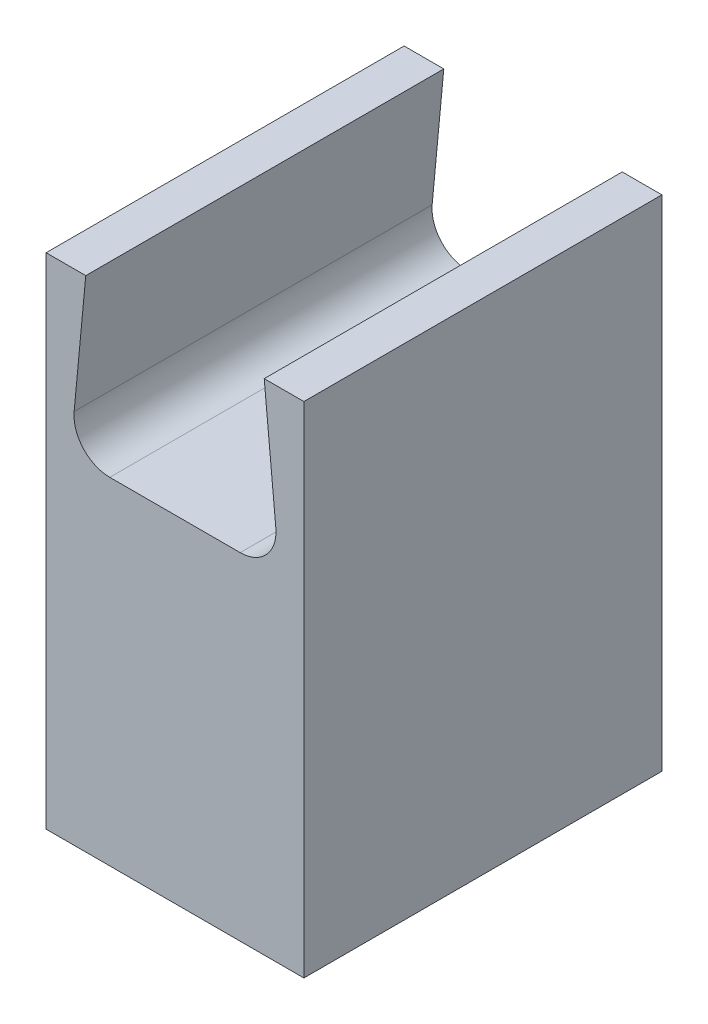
ISO-10303-21;
HEADER;
FILE_DESCRIPTION(('STEP AP214'),'2;1');
FILE_NAME('part.step','',(''),(''),'','','');
FILE_SCHEMA(('AUTOMOTIVE_DESIGN { 1 0 10303 214 1 1 1 1 }'));
ENDSEC;
DATA;
#1=APPLICATION_CONTEXT('core data for automotive mechanical design processes');
#2=APPLICATION_PROTOCOL_DEFINITION('international standard','automotive_design',2000,#1);
#3=PRODUCT_CONTEXT('',#1,'mechanical');
#4=PRODUCT('Part','Part','',(#3));
#5=PRODUCT_RELATED_PRODUCT_CATEGORY('part','',(#4));
#6=PRODUCT_DEFINITION_FORMATION('','',#4);
#7=PRODUCT_DEFINITION_CONTEXT('part definition',#1,'design');
#8=PRODUCT_DEFINITION('design','',#6,#7);
#9=PRODUCT_DEFINITION_SHAPE('','',#8);
#10=(LENGTH_UNIT() NAMED_UNIT(*) SI_UNIT(.MILLI.,.METRE.));
#11=(NAMED_UNIT(*) PLANE_ANGLE_UNIT() SI_UNIT($,.RADIAN.));
#12=(NAMED_UNIT(*) SI_UNIT($,.STERADIAN.) SOLID_ANGLE_UNIT());
#13=UNCERTAINTY_MEASURE_WITH_UNIT(LENGTH_MEASURE(1.E-05),#10,'distance_accuracy_value','');
#14=(GEOMETRIC_REPRESENTATION_CONTEXT(3) GLOBAL_UNCERTAINTY_ASSIGNED_CONTEXT((#13)) GLOBAL_UNIT_ASSIGNED_CONTEXT((#10,
#11,#12)) REPRESENTATION_CONTEXT('',''));
#15=CARTESIAN_POINT('',(0.,0.,0.));
#16=DIRECTION('',(0.,0.,1.));
#17=DIRECTION('',(1.,0.,0.));
#18=AXIS2_PLACEMENT_3D('',#15,#16,#17);
#19=CARTESIAN_POINT('',(-6.23,4.26,25.));
#20=DIRECTION('',(0.,-1.,0.));
#21=DIRECTION('',(0.,0.,-1.));
#22=AXIS2_PLACEMENT_3D('',#19,#20,#21);
#23=PLANE('',#22);
#24=DIRECTION('',(-1.,0.,0.));
#25=VECTOR('',#24,1.);
#26=CARTESIAN_POINT('',(-6.23,4.26,0.));
#27=LINE('',#26,#25);
#28=CARTESIAN_POINT('',(-6.23,4.26,0.));
#29=VERTEX_POINT('',#28);
#30=CARTESIAN_POINT('',(-9.,4.26,0.));
#31=VERTEX_POINT('',#30);
#32=EDGE_CURVE('E135',#29,#31,#27,.T.);
#33=ORIENTED_EDGE('',*,*,#32,.T.);
#34=DIRECTION('',(0.,0.,-1.));
#35=VECTOR('',#34,1.);
#36=CARTESIAN_POINT('',(-9.,4.26,25.));
#37=LINE('',#36,#35);
#38=CARTESIAN_POINT('',(-9.,4.26,25.));
#39=VERTEX_POINT('',#38);
#40=EDGE_CURVE('E116',#39,#31,#37,.T.);
#41=ORIENTED_EDGE('',*,*,#40,.F.);
#42=DIRECTION('',(-1.,0.,0.));
#43=VECTOR('',#42,1.);
#44=CARTESIAN_POINT('',(-6.23,4.26,25.));
#45=LINE('',#44,#43);
#46=CARTESIAN_POINT('',(-6.23,4.26,25.));
#47=VERTEX_POINT('',#46);
#48=EDGE_CURVE('E123',#47,#39,#45,.T.);
#49=ORIENTED_EDGE('',*,*,#48,.F.);
#50=DIRECTION('',(0.,0.,-1.));
#51=VECTOR('',#50,1.);
#52=CARTESIAN_POINT('',(-6.23,4.26,25.));
#53=LINE('',#52,#51);
#54=EDGE_CURVE('E163',#47,#29,#53,.T.);
#55=ORIENTED_EDGE('',*,*,#54,.T.);
#56=EDGE_LOOP('',(#33,#41,#49,#55));
#57=FACE_BOUND('',#56,.T.);
#58=ADVANCED_FACE('F35',(#57),#23,.F.);
#59=CARTESIAN_POINT('',(-9.,4.26,25.));
#60=DIRECTION('',(1.,0.,0.));
#61=DIRECTION('',(0.,0.,-1.));
#62=AXIS2_PLACEMENT_3D('',#59,#60,#61);
#63=PLANE('',#62);
#64=DIRECTION('',(0.,-1.,0.));
#65=VECTOR('',#64,1.);
#66=CARTESIAN_POINT('',(-9.,4.26,0.));
#67=LINE('',#66,#65);
#68=CARTESIAN_POINT('',(-9.,-30.6,0.));
#69=VERTEX_POINT('',#68);
#70=EDGE_CURVE('E199',#31,#69,#67,.T.);
#71=ORIENTED_EDGE('',*,*,#70,.T.);
#72=DIRECTION('',(0.,0.,-1.));
#73=VECTOR('',#72,1.);
#74=CARTESIAN_POINT('',(-9.,-30.6,25.));
#75=LINE('',#74,#73);
#76=CARTESIAN_POINT('',(-9.,-30.6,25.));
#77=VERTEX_POINT('',#76);
#78=EDGE_CURVE('E119',#77,#69,#75,.T.);
#79=ORIENTED_EDGE('',*,*,#78,.F.);
#80=DIRECTION('',(0.,-1.,0.));
#81=VECTOR('',#80,1.);
#82=CARTESIAN_POINT('',(-9.,4.26,25.));
#83=LINE('',#82,#81);
#84=EDGE_CURVE('E112',#39,#77,#83,.T.);
#85=ORIENTED_EDGE('',*,*,#84,.F.);
#86=ORIENTED_EDGE('',*,*,#40,.T.);
#87=EDGE_LOOP('',(#71,#79,#85,#86));
#88=FACE_BOUND('',#87,.T.);
#89=ADVANCED_FACE('F114',(#88),#63,.F.);
#90=CARTESIAN_POINT('',(-9.,-30.6,25.));
#91=DIRECTION('',(0.,1.,0.));
#92=DIRECTION('',(0.,0.,1.));
#93=AXIS2_PLACEMENT_3D('',#90,#91,#92);
#94=PLANE('',#93);
#95=DIRECTION('',(1.,0.,0.));
#96=VECTOR('',#95,1.);
#97=CARTESIAN_POINT('',(-9.,-30.6,0.));
#98=LINE('',#97,#96);
#99=CARTESIAN_POINT('',(9.,-30.6,0.));
#100=VERTEX_POINT('',#99);
#101=EDGE_CURVE('E197',#69,#100,#98,.T.);
#102=ORIENTED_EDGE('',*,*,#101,.T.);
#103=DIRECTION('',(0.,0.,-1.));
#104=VECTOR('',#103,1.);
#105=CARTESIAN_POINT('',(9.,-30.6,25.));
#106=LINE('',#105,#104);
#107=CARTESIAN_POINT('',(9.,-30.6,25.));
#108=VERTEX_POINT('',#107);
#109=EDGE_CURVE('E141',#108,#100,#106,.T.);
#110=ORIENTED_EDGE('',*,*,#109,.F.);
#111=DIRECTION('',(1.,0.,0.));
#112=VECTOR('',#111,1.);
#113=CARTESIAN_POINT('',(-9.,-30.6,25.));
#114=LINE('',#113,#112);
#115=EDGE_CURVE('E122',#77,#108,#114,.T.);
#116=ORIENTED_EDGE('',*,*,#115,.F.);
#117=ORIENTED_EDGE('',*,*,#78,.T.);
#118=EDGE_LOOP('',(#102,#110,#116,#117));
#119=FACE_BOUND('',#118,.T.);
#120=ADVANCED_FACE('F210',(#119),#94,.F.);
#121=CARTESIAN_POINT('',(9.,-30.6,25.));
#122=DIRECTION('',(-1.,0.,0.));
#123=DIRECTION('',(0.,-1.,0.));
#124=AXIS2_PLACEMENT_3D('',#121,#122,#123);
#125=PLANE('',#124);
#126=DIRECTION('',(0.,1.,0.));
#127=VECTOR('',#126,1.);
#128=CARTESIAN_POINT('',(9.,-30.6,0.));
#129=LINE('',#128,#127);
#130=CARTESIAN_POINT('',(9.,4.26,0.));
#131=VERTEX_POINT('',#130);
#132=EDGE_CURVE('E192',#100,#131,#129,.T.);
#133=ORIENTED_EDGE('',*,*,#132,.T.);
#134=DIRECTION('',(0.,0.,-1.));
#135=VECTOR('',#134,1.);
#136=CARTESIAN_POINT('',(9.,4.26,25.));
#137=LINE('',#136,#135);
#138=CARTESIAN_POINT('',(9.,4.26,25.));
#139=VERTEX_POINT('',#138);
#140=EDGE_CURVE('E183',#139,#131,#137,.T.);
#141=ORIENTED_EDGE('',*,*,#140,.F.);
#142=DIRECTION('',(0.,1.,0.));
#143=VECTOR('',#142,1.);
#144=CARTESIAN_POINT('',(9.,-30.6,25.));
#145=LINE('',#144,#143);
#146=EDGE_CURVE('E193',#108,#139,#145,.T.);
#147=ORIENTED_EDGE('',*,*,#146,.F.);
#148=ORIENTED_EDGE('',*,*,#109,.T.);
#149=EDGE_LOOP('',(#133,#141,#147,#148));
#150=FACE_BOUND('',#149,.T.);
#151=ADVANCED_FACE('F190',(#150),#125,.F.);
#152=CARTESIAN_POINT('',(9.,4.26,25.));
#153=DIRECTION('',(0.,-1.,0.));
#154=DIRECTION('',(1.,0.,0.));
#155=AXIS2_PLACEMENT_3D('',#152,#153,#154);
#156=PLANE('',#155);
#157=DIRECTION('',(-1.,0.,0.));
#158=VECTOR('',#157,1.);
#159=CARTESIAN_POINT('',(9.,4.26,0.));
#160=LINE('',#159,#158);
#161=CARTESIAN_POINT('',(6.23,4.26,0.));
#162=VERTEX_POINT('',#161);
#163=EDGE_CURVE('E175',#131,#162,#160,.T.);
#164=ORIENTED_EDGE('',*,*,#163,.T.);
#165=DIRECTION('',(0.,0.,-1.));
#166=VECTOR('',#165,1.);
#167=CARTESIAN_POINT('',(6.23,4.26,25.));
#168=LINE('',#167,#166);
#169=CARTESIAN_POINT('',(6.23,4.26,25.));
#170=VERTEX_POINT('',#169);
#171=EDGE_CURVE('E180',#170,#162,#168,.T.);
#172=ORIENTED_EDGE('',*,*,#171,.F.);
#173=DIRECTION('',(-1.,0.,0.));
#174=VECTOR('',#173,1.);
#175=CARTESIAN_POINT('',(9.,4.26,25.));
#176=LINE('',#175,#174);
#177=EDGE_CURVE('E207',#139,#170,#176,.T.);
#178=ORIENTED_EDGE('',*,*,#177,.F.);
#179=ORIENTED_EDGE('',*,*,#140,.T.);
#180=EDGE_LOOP('',(#164,#172,#178,#179));
#181=FACE_BOUND('',#180,.T.);
#182=ADVANCED_FACE('F217',(#181),#156,.F.);
#183=CARTESIAN_POINT('',(6.23,4.26,25.));
#184=DIRECTION('',(0.995593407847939,0.0937750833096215,0.));
#185=DIRECTION('',(-0.0937750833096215,0.99559340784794,0.));
#186=AXIS2_PLACEMENT_3D('',#183,#184,#185);
#187=PLANE('',#186);
#188=DIRECTION('',(0.0937750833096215,-0.995593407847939,0.));
#189=VECTOR('',#188,1.);
#190=CARTESIAN_POINT('',(6.23,4.26,0.));
#191=LINE('',#190,#189);
#192=CARTESIAN_POINT('',(7.0424429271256,-4.36556229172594,0.));
#193=VERTEX_POINT('',#192);
#194=EDGE_CURVE('E172',#162,#193,#191,.T.);
#195=ORIENTED_EDGE('',*,*,#194,.T.);
#196=DIRECTION('',(0.,0.,-1.));
#197=VECTOR('',#196,1.);
#198=CARTESIAN_POINT('',(7.0424429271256,-4.36556229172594,25.));
#199=LINE('',#198,#197);
#200=CARTESIAN_POINT('',(7.0424429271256,-4.36556229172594,25.));
#201=VERTEX_POINT('',#200);
#202=EDGE_CURVE('E50',#193,#201,#199,.F.);
#203=ORIENTED_EDGE('',*,*,#202,.T.);
#204=DIRECTION('',(0.0937750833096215,-0.995593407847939,0.));
#205=VECTOR('',#204,1.);
#206=CARTESIAN_POINT('',(6.23,4.26,25.));
#207=LINE('',#206,#205);
#208=EDGE_CURVE('E205',#170,#201,#207,.T.);
#209=ORIENTED_EDGE('',*,*,#208,.F.);
#210=ORIENTED_EDGE('',*,*,#171,.T.);
#211=EDGE_LOOP('',(#195,#203,#209,#210));
#212=FACE_BOUND('',#211,.T.);
#213=ADVANCED_FACE('F240',(#212),#187,.F.);
#214=CARTESIAN_POINT('',(7.3,-7.1,25.));
#215=DIRECTION('',(0.,-1.,0.));
#216=DIRECTION('',(1.,0.,0.));
#217=AXIS2_PLACEMENT_3D('',#214,#215,#216);
#218=PLANE('',#217);
#219=DIRECTION('',(-1.,0.,0.));
#220=VECTOR('',#219,1.);
#221=CARTESIAN_POINT('',(7.3,-7.1,0.));
#222=LINE('',#221,#220);
#223=CARTESIAN_POINT('',(4.55345940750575,-7.1,0.));
#224=VERTEX_POINT('',#223);
#225=CARTESIAN_POINT('',(-4.55345940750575,-7.1,0.));
#226=VERTEX_POINT('',#225);
#227=EDGE_CURVE('E168',#224,#226,#222,.T.);
#228=ORIENTED_EDGE('',*,*,#227,.T.);
#229=DIRECTION('',(0.,0.,-1.));
#230=VECTOR('',#229,1.);
#231=CARTESIAN_POINT('',(-4.55345940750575,-7.1,25.));
#232=LINE('',#231,#230);
#233=CARTESIAN_POINT('',(-4.55345940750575,-7.1,25.));
#234=VERTEX_POINT('',#233);
#235=EDGE_CURVE('E147',#226,#234,#232,.F.);
#236=ORIENTED_EDGE('',*,*,#235,.T.);
#237=DIRECTION('',(-1.,0.,0.));
#238=VECTOR('',#237,1.);
#239=CARTESIAN_POINT('',(7.3,-7.1,25.));
#240=LINE('',#239,#238);
#241=CARTESIAN_POINT('',(4.55345940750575,-7.1,25.));
#242=VERTEX_POINT('',#241);
#243=EDGE_CURVE('E156',#242,#234,#240,.T.);
#244=ORIENTED_EDGE('',*,*,#243,.F.);
#245=DIRECTION('',(0.,0.,-1.));
#246=VECTOR('',#245,1.);
#247=CARTESIAN_POINT('',(4.55345940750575,-7.1,0.));
#248=LINE('',#247,#246);
#249=EDGE_CURVE('E139',#242,#224,#248,.T.);
#250=ORIENTED_EDGE('',*,*,#249,.T.);
#251=EDGE_LOOP('',(#228,#236,#244,#250));
#252=FACE_BOUND('',#251,.T.);
#253=ADVANCED_FACE('F170',(#252),#218,.F.);
#254=CARTESIAN_POINT('',(-7.3,-7.1,25.));
#255=DIRECTION('',(-0.995593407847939,0.093775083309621,0.));
#256=DIRECTION('',(-0.093775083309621,-0.995593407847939,0.));
#257=AXIS2_PLACEMENT_3D('',#254,#255,#256);
#258=PLANE('',#257);
#259=DIRECTION('',(0.093775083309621,0.995593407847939,0.));
#260=VECTOR('',#259,1.);
#261=CARTESIAN_POINT('',(-7.3,-7.1,25.));
#262=LINE('',#261,#260);
#263=CARTESIAN_POINT('',(-7.04244292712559,-4.36556229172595,25.));
#264=VERTEX_POINT('',#263);
#265=EDGE_CURVE('E128',#264,#47,#262,.T.);
#266=ORIENTED_EDGE('',*,*,#265,.F.);
#267=DIRECTION('',(0.,0.,-1.));
#268=VECTOR('',#267,1.);
#269=CARTESIAN_POINT('',(-7.04244292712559,-4.36556229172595,0.));
#270=LINE('',#269,#268);
#271=CARTESIAN_POINT('',(-7.04244292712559,-4.36556229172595,0.));
#272=VERTEX_POINT('',#271);
#273=EDGE_CURVE('E136',#264,#272,#270,.T.);
#274=ORIENTED_EDGE('',*,*,#273,.T.);
#275=DIRECTION('',(0.093775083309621,0.995593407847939,0.));
#276=VECTOR('',#275,1.);
#277=CARTESIAN_POINT('',(-7.3,-7.1,0.));
#278=LINE('',#277,#276);
#279=EDGE_CURVE('E132',#272,#29,#278,.T.);
#280=ORIENTED_EDGE('',*,*,#279,.T.);
#281=ORIENTED_EDGE('',*,*,#54,.F.);
#282=EDGE_LOOP('',(#266,#274,#280,#281));
#283=FACE_BOUND('',#282,.T.);
#284=ADVANCED_FACE('F161',(#283),#258,.F.);
#285=CARTESIAN_POINT('',(0.,0.,25.));
#286=DIRECTION('',(0.,0.,1.));
#287=DIRECTION('',(1.,0.,0.));
#288=AXIS2_PLACEMENT_3D('',#285,#286,#287);
#289=PLANE('',#288);
#290=ORIENTED_EDGE('',*,*,#48,.T.);
#291=ORIENTED_EDGE('',*,*,#84,.T.);
#292=ORIENTED_EDGE('',*,*,#115,.T.);
#293=ORIENTED_EDGE('',*,*,#146,.T.);
#294=ORIENTED_EDGE('',*,*,#177,.T.);
#295=ORIENTED_EDGE('',*,*,#208,.T.);
#296=CARTESIAN_POINT('',(4.55345940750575,-4.6,25.));
#297=DIRECTION('',(0.,0.,1.));
#298=DIRECTION('',(1.,0.,0.));
#299=AXIS2_PLACEMENT_3D('',#296,#297,#298);
#300=CIRCLE('',#299,2.5);
#301=EDGE_CURVE('E11',#201,#242,#300,.F.);
#302=ORIENTED_EDGE('',*,*,#301,.T.);
#303=ORIENTED_EDGE('',*,*,#243,.T.);
#304=CARTESIAN_POINT('',(-4.55345940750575,-4.6,25.));
#305=DIRECTION('',(0.,0.,1.));
#306=DIRECTION('',(1.,0.,0.));
#307=AXIS2_PLACEMENT_3D('',#304,#305,#306);
#308=CIRCLE('',#307,2.5);
#309=EDGE_CURVE('E152',#234,#264,#308,.F.);
#310=ORIENTED_EDGE('',*,*,#309,.T.);
#311=ORIENTED_EDGE('',*,*,#265,.T.);
#312=EDGE_LOOP('',(#290,#291,#292,#293,#294,#295,#302,#303,#310,#311));
#313=FACE_BOUND('',#312,.T.);
#314=ADVANCED_FACE('F126',(#313),#289,.T.);
#315=CARTESIAN_POINT('',(0.,0.,0.));
#316=DIRECTION('',(0.,0.,1.));
#317=DIRECTION('',(1.,0.,0.));
#318=AXIS2_PLACEMENT_3D('',#315,#316,#317);
#319=PLANE('',#318);
#320=ORIENTED_EDGE('',*,*,#32,.F.);
#321=ORIENTED_EDGE('',*,*,#279,.F.);
#322=CARTESIAN_POINT('',(-4.55345940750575,-4.6,0.));
#323=DIRECTION('',(0.,0.,1.));
#324=DIRECTION('',(1.,0.,0.));
#325=AXIS2_PLACEMENT_3D('',#322,#323,#324);
#326=CIRCLE('',#325,2.5);
#327=EDGE_CURVE('E150',#272,#226,#326,.T.);
#328=ORIENTED_EDGE('',*,*,#327,.T.);
#329=ORIENTED_EDGE('',*,*,#227,.F.);
#330=CARTESIAN_POINT('',(4.55345940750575,-4.6,0.));
#331=DIRECTION('',(0.,0.,1.));
#332=DIRECTION('',(1.,0.,0.));
#333=AXIS2_PLACEMENT_3D('',#330,#331,#332);
#334=CIRCLE('',#333,2.5);
#335=EDGE_CURVE('E43',#224,#193,#334,.T.);
#336=ORIENTED_EDGE('',*,*,#335,.T.);
#337=ORIENTED_EDGE('',*,*,#194,.F.);
#338=ORIENTED_EDGE('',*,*,#163,.F.);
#339=ORIENTED_EDGE('',*,*,#132,.F.);
#340=ORIENTED_EDGE('',*,*,#101,.F.);
#341=ORIENTED_EDGE('',*,*,#70,.F.);
#342=EDGE_LOOP('',(#320,#321,#328,#329,#336,#337,#338,#339,#340,#341));
#343=FACE_BOUND('',#342,.T.);
#344=ADVANCED_FACE('F167',(#343),#319,.F.);
#345=CARTESIAN_POINT('',(-4.55345940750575,-4.6,25.));
#346=DIRECTION('',(0.,0.,1.));
#347=DIRECTION('',(1.,0.,0.));
#348=AXIS2_PLACEMENT_3D('',#345,#346,#347);
#349=CYLINDRICAL_SURFACE('',#348,2.5);
#350=ORIENTED_EDGE('',*,*,#309,.F.);
#351=ORIENTED_EDGE('',*,*,#235,.F.);
#352=ORIENTED_EDGE('',*,*,#327,.F.);
#353=ORIENTED_EDGE('',*,*,#273,.F.);
#354=EDGE_LOOP('',(#350,#351,#352,#353));
#355=FACE_BOUND('',#354,.T.);
#356=ADVANCED_FACE('F165',(#355),#349,.F.);
#357=CARTESIAN_POINT('',(4.55345940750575,-4.6,25.));
#358=DIRECTION('',(0.,0.,1.));
#359=DIRECTION('',(1.,0.,0.));
#360=AXIS2_PLACEMENT_3D('',#357,#358,#359);
#361=CYLINDRICAL_SURFACE('',#360,2.5);
#362=ORIENTED_EDGE('',*,*,#301,.F.);
#363=ORIENTED_EDGE('',*,*,#202,.F.);
#364=ORIENTED_EDGE('',*,*,#335,.F.);
#365=ORIENTED_EDGE('',*,*,#249,.F.);
#366=EDGE_LOOP('',(#362,#363,#364,#365));
#367=FACE_BOUND('',#366,.T.);
#368=ADVANCED_FACE('F37',(#367),#361,.F.);
#369=CLOSED_SHELL('',(#58,#89,#120,#151,#182,#213,#253,#284,#314,#344,#356,#368));
#370=MANIFOLD_SOLID_BREP('B2',#369);
#371=ADVANCED_BREP_SHAPE_REPRESENTATION('',(#18,#370),#14);
#372=SHAPE_DEFINITION_REPRESENTATION(#9,#371);
ENDSEC;
END-ISO-10303-21;
